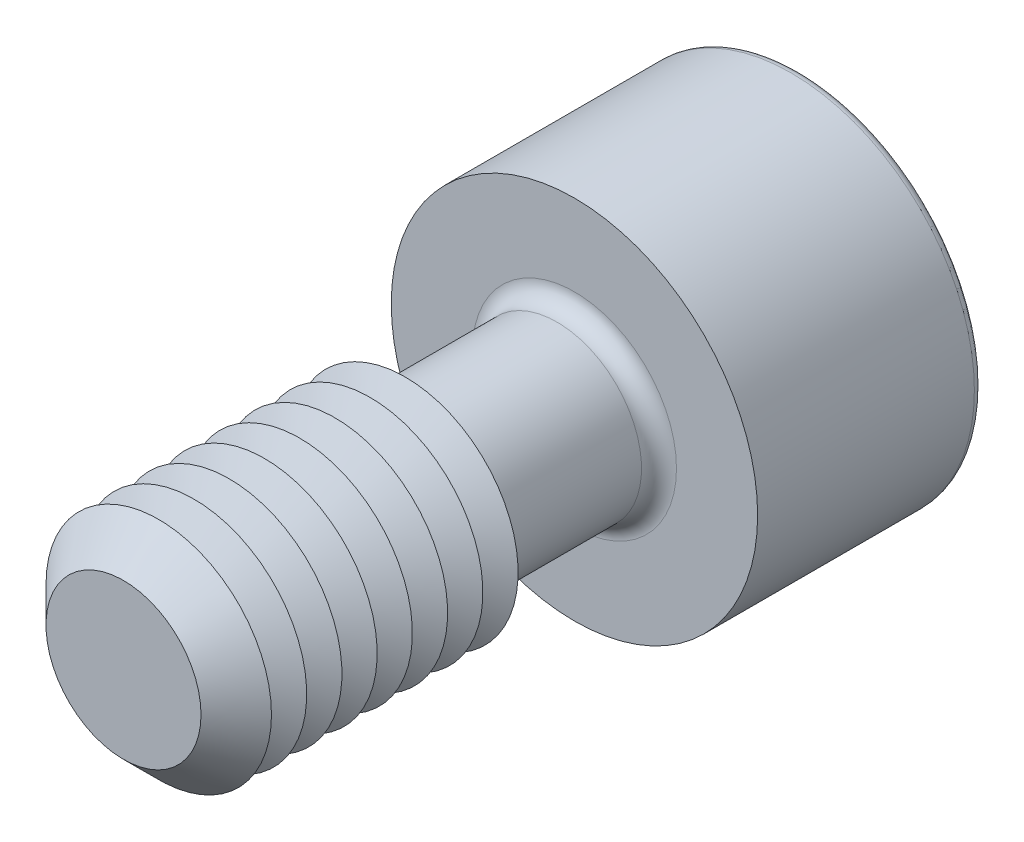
ISO-10303-21;
HEADER;
FILE_DESCRIPTION(('STEP AP214'),'2;1');
FILE_NAME('part.step','',(''),(''),'','','');
FILE_SCHEMA(('AUTOMOTIVE_DESIGN { 1 0 10303 214 1 1 1 1 }'));
ENDSEC;
DATA;
#1=APPLICATION_CONTEXT('core data for automotive mechanical design processes');
#2=APPLICATION_PROTOCOL_DEFINITION('international standard','automotive_design',2000,#1);
#3=PRODUCT_CONTEXT('',#1,'mechanical');
#4=PRODUCT('Part','Part','',(#3));
#5=PRODUCT_RELATED_PRODUCT_CATEGORY('part','',(#4));
#6=PRODUCT_DEFINITION_FORMATION('','',#4);
#7=PRODUCT_DEFINITION_CONTEXT('part definition',#1,'design');
#8=PRODUCT_DEFINITION('design','',#6,#7);
#9=PRODUCT_DEFINITION_SHAPE('','',#8);
#10=(LENGTH_UNIT() NAMED_UNIT(*) SI_UNIT(.MILLI.,.METRE.));
#11=(NAMED_UNIT(*) PLANE_ANGLE_UNIT() SI_UNIT($,.RADIAN.));
#12=(NAMED_UNIT(*) SI_UNIT($,.STERADIAN.) SOLID_ANGLE_UNIT());
#13=UNCERTAINTY_MEASURE_WITH_UNIT(LENGTH_MEASURE(1.E-05),#10,'distance_accuracy_value','');
#14=(GEOMETRIC_REPRESENTATION_CONTEXT(3) GLOBAL_UNCERTAINTY_ASSIGNED_CONTEXT((#13)) GLOBAL_UNIT_ASSIGNED_CONTEXT((#10,
#11,#12)) REPRESENTATION_CONTEXT('',''));
#15=CARTESIAN_POINT('',(0.,0.,0.));
#16=DIRECTION('',(0.,0.,1.));
#17=DIRECTION('',(1.,0.,0.));
#18=AXIS2_PLACEMENT_3D('',#15,#16,#17);
#19=CARTESIAN_POINT('',(-1.73205080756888,-3.,-10.));
#20=DIRECTION('',(0.,0.,1.));
#21=DIRECTION('',(1.,0.,0.));
#22=AXIS2_PLACEMENT_3D('',#19,#20,#21);
#23=PLANE('',#22);
#24=DIRECTION('',(1.,0.,0.));
#25=VECTOR('',#24,1.);
#26=CARTESIAN_POINT('',(-1.73205080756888,-3.,-10.));
#27=LINE('',#26,#25);
#28=CARTESIAN_POINT('',(0.,-3.,-10.));
#29=VERTEX_POINT('',#28);
#30=CARTESIAN_POINT('',(1.73205080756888,-3.,-10.));
#31=VERTEX_POINT('',#30);
#32=EDGE_CURVE('E405',#29,#31,#27,.T.);
#33=ORIENTED_EDGE('',*,*,#32,.F.);
#34=CARTESIAN_POINT('',(0.,0.,-10.));
#35=DIRECTION('',(0.,0.,1.));
#36=DIRECTION('',(0.,-1.,0.));
#37=AXIS2_PLACEMENT_3D('',#34,#35,#36);
#38=CIRCLE('',#37,3.);
#39=CARTESIAN_POINT('',(2.59807621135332,-1.5,-10.));
#40=VERTEX_POINT('',#39);
#41=EDGE_CURVE('E53',#29,#40,#38,.T.);
#42=ORIENTED_EDGE('',*,*,#41,.T.);
#43=DIRECTION('',(0.5,0.866025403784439,0.));
#44=VECTOR('',#43,1.);
#45=CARTESIAN_POINT('',(1.73205080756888,-3.,-10.));
#46=LINE('',#45,#44);
#47=EDGE_CURVE('E395',#31,#40,#46,.T.);
#48=ORIENTED_EDGE('',*,*,#47,.F.);
#49=EDGE_LOOP('',(#33,#42,#48));
#50=FACE_BOUND('',#49,.T.);
#51=ADVANCED_FACE('F41',(#50),#23,.F.);
#52=CARTESIAN_POINT('',(3.46410161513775,0.,-10.));
#53=VERTEX_POINT('',#52);
#54=EDGE_CURVE('E399',#40,#53,#46,.T.);
#55=ORIENTED_EDGE('',*,*,#54,.F.);
#56=CARTESIAN_POINT('',(2.59807621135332,1.5,-10.));
#57=VERTEX_POINT('',#56);
#58=EDGE_CURVE('E11',#40,#57,#38,.T.);
#59=ORIENTED_EDGE('',*,*,#58,.T.);
#60=DIRECTION('',(-0.5,0.866025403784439,0.));
#61=VECTOR('',#60,1.);
#62=CARTESIAN_POINT('',(3.46410161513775,0.,-10.));
#63=LINE('',#62,#61);
#64=EDGE_CURVE('E391',#53,#57,#63,.T.);
#65=ORIENTED_EDGE('',*,*,#64,.F.);
#66=EDGE_LOOP('',(#55,#59,#65));
#67=FACE_BOUND('',#66,.T.);
#68=ADVANCED_FACE('F133',(#67),#23,.F.);
#69=CARTESIAN_POINT('',(1.73205080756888,3.,-10.));
#70=VERTEX_POINT('',#69);
#71=EDGE_CURVE('E390',#57,#70,#63,.T.);
#72=ORIENTED_EDGE('',*,*,#71,.F.);
#73=CARTESIAN_POINT('',(0.,3.00000000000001,-9.99999999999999));
#74=VERTEX_POINT('',#73);
#75=EDGE_CURVE('E51',#57,#74,#38,.T.);
#76=ORIENTED_EDGE('',*,*,#75,.T.);
#77=DIRECTION('',(-1.,0.,0.));
#78=VECTOR('',#77,1.);
#79=CARTESIAN_POINT('',(1.73205080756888,3.,-10.));
#80=LINE('',#79,#78);
#81=EDGE_CURVE('E177',#70,#74,#80,.T.);
#82=ORIENTED_EDGE('',*,*,#81,.F.);
#83=EDGE_LOOP('',(#72,#76,#82));
#84=FACE_BOUND('',#83,.T.);
#85=ADVANCED_FACE('F139',(#84),#23,.F.);
#86=CARTESIAN_POINT('',(-1.73205080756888,3.,-10.));
#87=VERTEX_POINT('',#86);
#88=EDGE_CURVE('E397',#74,#87,#80,.T.);
#89=ORIENTED_EDGE('',*,*,#88,.F.);
#90=CARTESIAN_POINT('',(-2.59807621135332,1.5,-10.));
#91=VERTEX_POINT('',#90);
#92=EDGE_CURVE('E265',#74,#91,#38,.T.);
#93=ORIENTED_EDGE('',*,*,#92,.T.);
#94=DIRECTION('',(-0.5,-0.866025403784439,0.));
#95=VECTOR('',#94,1.);
#96=CARTESIAN_POINT('',(-1.73205080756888,3.,-10.));
#97=LINE('',#96,#95);
#98=EDGE_CURVE('E176',#87,#91,#97,.T.);
#99=ORIENTED_EDGE('',*,*,#98,.F.);
#100=EDGE_LOOP('',(#89,#93,#99));
#101=FACE_BOUND('',#100,.T.);
#102=ADVANCED_FACE('F157',(#101),#23,.F.);
#103=CARTESIAN_POINT('',(-3.46410161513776,0.,-10.));
#104=VERTEX_POINT('',#103);
#105=EDGE_CURVE('E170',#91,#104,#97,.T.);
#106=ORIENTED_EDGE('',*,*,#105,.F.);
#107=CARTESIAN_POINT('',(-2.59807621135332,-1.5,-10.));
#108=VERTEX_POINT('',#107);
#109=EDGE_CURVE('E172',#91,#108,#38,.T.);
#110=ORIENTED_EDGE('',*,*,#109,.T.);
#111=DIRECTION('',(0.5,-0.866025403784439,0.));
#112=VECTOR('',#111,1.);
#113=CARTESIAN_POINT('',(-3.46410161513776,0.,-10.));
#114=LINE('',#113,#112);
#115=EDGE_CURVE('E174',#104,#108,#114,.T.);
#116=ORIENTED_EDGE('',*,*,#115,.F.);
#117=EDGE_LOOP('',(#106,#110,#116));
#118=FACE_BOUND('',#117,.T.);
#119=ADVANCED_FACE('F146',(#118),#23,.F.);
#120=CARTESIAN_POINT('',(0.,0.,-16.));
#121=DIRECTION('',(0.,0.,-1.));
#122=DIRECTION('',(-1.,0.,0.));
#123=AXIS2_PLACEMENT_3D('',#120,#121,#122);
#124=PLANE('',#123);
#125=CARTESIAN_POINT('',(0.,0.,-16.));
#126=DIRECTION('',(0.,0.,-1.));
#127=DIRECTION('',(-1.,0.,0.));
#128=AXIS2_PLACEMENT_3D('',#125,#126,#127);
#129=CIRCLE('',#128,6.19);
#130=CARTESIAN_POINT('',(-6.19,0.,-16.));
#131=VERTEX_POINT('',#130);
#132=EDGE_CURVE('E250',#131,#131,#129,.T.);
#133=ORIENTED_EDGE('',*,*,#132,.T.);
#134=EDGE_LOOP('',(#133));
#135=FACE_BOUND('',#134,.T.);
#136=DIRECTION('',(-0.5,-0.866025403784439,0.));
#137=VECTOR('',#136,1.);
#138=CARTESIAN_POINT('',(-1.73205080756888,3.,-16.));
#139=LINE('',#138,#137);
#140=CARTESIAN_POINT('',(-1.73205080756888,3.,-16.));
#141=VERTEX_POINT('',#140);
#142=CARTESIAN_POINT('',(-3.46410161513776,0.,-16.));
#143=VERTEX_POINT('',#142);
#144=EDGE_CURVE('E212',#141,#143,#139,.T.);
#145=ORIENTED_EDGE('',*,*,#144,.T.);
#146=DIRECTION('',(0.5,-0.866025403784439,0.));
#147=VECTOR('',#146,1.);
#148=CARTESIAN_POINT('',(-3.46410161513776,0.,-16.));
#149=LINE('',#148,#147);
#150=CARTESIAN_POINT('',(-1.73205080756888,-3.,-16.));
#151=VERTEX_POINT('',#150);
#152=EDGE_CURVE('E67',#143,#151,#149,.T.);
#153=ORIENTED_EDGE('',*,*,#152,.T.);
#154=DIRECTION('',(1.,0.,0.));
#155=VECTOR('',#154,1.);
#156=CARTESIAN_POINT('',(-1.73205080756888,-3.,-16.));
#157=LINE('',#156,#155);
#158=CARTESIAN_POINT('',(1.73205080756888,-3.,-16.));
#159=VERTEX_POINT('',#158);
#160=EDGE_CURVE('E196',#151,#159,#157,.T.);
#161=ORIENTED_EDGE('',*,*,#160,.T.);
#162=DIRECTION('',(0.5,0.866025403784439,0.));
#163=VECTOR('',#162,1.);
#164=CARTESIAN_POINT('',(1.73205080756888,-3.,-16.));
#165=LINE('',#164,#163);
#166=CARTESIAN_POINT('',(3.46410161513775,0.,-16.));
#167=VERTEX_POINT('',#166);
#168=EDGE_CURVE('E200',#159,#167,#165,.T.);
#169=ORIENTED_EDGE('',*,*,#168,.T.);
#170=DIRECTION('',(-0.5,0.866025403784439,0.));
#171=VECTOR('',#170,1.);
#172=CARTESIAN_POINT('',(3.46410161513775,0.,-16.));
#173=LINE('',#172,#171);
#174=CARTESIAN_POINT('',(1.73205080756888,3.,-16.));
#175=VERTEX_POINT('',#174);
#176=EDGE_CURVE('E204',#167,#175,#173,.T.);
#177=ORIENTED_EDGE('',*,*,#176,.T.);
#178=DIRECTION('',(-1.,0.,0.));
#179=VECTOR('',#178,1.);
#180=CARTESIAN_POINT('',(1.73205080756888,3.,-16.));
#181=LINE('',#180,#179);
#182=EDGE_CURVE('E208',#175,#141,#181,.T.);
#183=ORIENTED_EDGE('',*,*,#182,.T.);
#184=EDGE_LOOP('',(#145,#153,#161,#169,#177,#183));
#185=FACE_BOUND('',#184,.T.);
#186=ADVANCED_FACE('F156',(#135,#185),#124,.T.);
#187=CARTESIAN_POINT('',(0.,0.,8.));
#188=DIRECTION('',(0.,0.,-1.));
#189=DIRECTION('',(-1.,0.,0.));
#190=AXIS2_PLACEMENT_3D('',#187,#188,#189);
#191=CYLINDRICAL_SURFACE('',#190,3.);
#192=CARTESIAN_POINT('',(0.,0.,-7.38));
#193=DIRECTION('',(0.,0.,-1.));
#194=DIRECTION('',(-1.,0.,0.));
#195=AXIS2_PLACEMENT_3D('',#192,#193,#194);
#196=CIRCLE('',#195,3.);
#197=CARTESIAN_POINT('',(-3.,0.,-7.38));
#198=VERTEX_POINT('',#197);
#199=EDGE_CURVE('E247',#198,#198,#196,.F.);
#200=ORIENTED_EDGE('',*,*,#199,.T.);
#201=EDGE_LOOP('',(#200));
#202=FACE_BOUND('',#201,.T.);
#203=CARTESIAN_POINT('',(0.,0.,-2.57735026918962));
#204=DIRECTION('',(0.,0.,-1.));
#205=DIRECTION('',(0.,1.,0.));
#206=AXIS2_PLACEMENT_3D('',#203,#204,#205);
#207=CIRCLE('',#206,3.);
#208=CARTESIAN_POINT('',(0.,3.,-2.57735026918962));
#209=VERTEX_POINT('',#208);
#210=EDGE_CURVE('E235',#209,#209,#207,.T.);
#211=ORIENTED_EDGE('',*,*,#210,.T.);
#212=EDGE_LOOP('',(#211));
#213=FACE_BOUND('',#212,.T.);
#214=ADVANCED_FACE('F163',(#202,#213),#191,.T.);
#215=CARTESIAN_POINT('',(0.,0.,-2.57735026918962));
#216=DIRECTION('',(0.,0.,1.));
#217=DIRECTION('',(0.,-1.,0.));
#218=AXIS2_PLACEMENT_3D('',#215,#216,#217);
#219=CONICAL_SURFACE('',#218,3.,1.0471975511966);
#220=CARTESIAN_POINT('',(0.,0.,-2.));
#221=DIRECTION('',(0.,0.,-1.));
#222=DIRECTION('',(-1.,0.,0.));
#223=AXIS2_PLACEMENT_3D('',#220,#221,#222);
#224=CIRCLE('',#223,4.);
#225=CARTESIAN_POINT('',(-4.,0.,-2.));
#226=VERTEX_POINT('',#225);
#227=EDGE_CURVE('E268',#226,#226,#224,.T.);
#228=ORIENTED_EDGE('',*,*,#227,.T.);
#229=EDGE_LOOP('',(#228));
#230=FACE_BOUND('',#229,.T.);
#231=ORIENTED_EDGE('',*,*,#210,.F.);
#232=EDGE_LOOP('',(#231));
#233=FACE_BOUND('',#232,.T.);
#234=ADVANCED_FACE('F348',(#230,#233),#219,.T.);
#235=CARTESIAN_POINT('',(0.,0.,-8.));
#236=DIRECTION('',(0.,0.,-1.));
#237=DIRECTION('',(-1.,0.,0.));
#238=AXIS2_PLACEMENT_3D('',#235,#236,#237);
#239=PLANE('',#238);
#240=CARTESIAN_POINT('',(0.,0.,-8.));
#241=DIRECTION('',(0.,0.,-1.));
#242=DIRECTION('',(-1.,0.,0.));
#243=AXIS2_PLACEMENT_3D('',#240,#241,#242);
#244=CIRCLE('',#243,3.62);
#245=CARTESIAN_POINT('',(-3.62,0.,-8.));
#246=VERTEX_POINT('',#245);
#247=EDGE_CURVE('E243',#246,#246,#244,.T.);
#248=ORIENTED_EDGE('',*,*,#247,.T.);
#249=EDGE_LOOP('',(#248));
#250=FACE_BOUND('',#249,.T.);
#251=CARTESIAN_POINT('',(0.,0.,-8.));
#252=DIRECTION('',(0.,0.,-1.));
#253=DIRECTION('',(-1.,0.,0.));
#254=AXIS2_PLACEMENT_3D('',#251,#252,#253);
#255=CIRCLE('',#254,6.5);
#256=CARTESIAN_POINT('',(-6.5,0.,-8.));
#257=VERTEX_POINT('',#256);
#258=EDGE_CURVE('E231',#257,#257,#255,.T.);
#259=ORIENTED_EDGE('',*,*,#258,.F.);
#260=EDGE_LOOP('',(#259));
#261=FACE_BOUND('',#260,.T.);
#262=ADVANCED_FACE('F353',(#250,#261),#239,.F.);
#263=CARTESIAN_POINT('',(0.,0.,-16.));
#264=DIRECTION('',(0.,0.,1.));
#265=DIRECTION('',(1.,0.,0.));
#266=AXIS2_PLACEMENT_3D('',#263,#264,#265);
#267=CYLINDRICAL_SURFACE('',#266,6.5);
#268=CARTESIAN_POINT('',(0.,0.,-15.69));
#269=DIRECTION('',(0.,0.,-1.));
#270=DIRECTION('',(-1.,0.,0.));
#271=AXIS2_PLACEMENT_3D('',#268,#269,#270);
#272=CIRCLE('',#271,6.5);
#273=CARTESIAN_POINT('',(-6.5,0.,-15.69));
#274=VERTEX_POINT('',#273);
#275=EDGE_CURVE('E45',#274,#274,#272,.F.);
#276=ORIENTED_EDGE('',*,*,#275,.T.);
#277=EDGE_LOOP('',(#276));
#278=FACE_BOUND('',#277,.T.);
#279=ORIENTED_EDGE('',*,*,#258,.T.);
#280=EDGE_LOOP('',(#279));
#281=FACE_BOUND('',#280,.T.);
#282=ADVANCED_FACE('F354',(#278,#281),#267,.T.);
#283=CARTESIAN_POINT('',(-3.46410161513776,0.,-10.));
#284=DIRECTION('',(0.866025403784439,0.5,0.));
#285=DIRECTION('',(-0.5,0.866025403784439,0.));
#286=AXIS2_PLACEMENT_3D('',#283,#284,#285);
#287=PLANE('',#286);
#288=ORIENTED_EDGE('',*,*,#152,.F.);
#289=DIRECTION('',(0.,0.,-1.));
#290=VECTOR('',#289,1.);
#291=CARTESIAN_POINT('',(-3.46410161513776,0.,-10.));
#292=LINE('',#291,#290);
#293=EDGE_CURVE('E186',#104,#143,#292,.T.);
#294=ORIENTED_EDGE('',*,*,#293,.F.);
#295=ORIENTED_EDGE('',*,*,#115,.T.);
#296=CARTESIAN_POINT('',(-1.73205080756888,-3.,-10.));
#297=VERTEX_POINT('',#296);
#298=EDGE_CURVE('E215',#108,#297,#114,.T.);
#299=ORIENTED_EDGE('',*,*,#298,.T.);
#300=DIRECTION('',(0.,0.,-1.));
#301=VECTOR('',#300,1.);
#302=CARTESIAN_POINT('',(-1.73205080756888,-3.,-10.));
#303=LINE('',#302,#301);
#304=EDGE_CURVE('E228',#297,#151,#303,.T.);
#305=ORIENTED_EDGE('',*,*,#304,.T.);
#306=EDGE_LOOP('',(#288,#294,#295,#299,#305));
#307=FACE_BOUND('',#306,.T.);
#308=ADVANCED_FACE('F357',(#307),#287,.T.);
#309=CARTESIAN_POINT('',(-1.73205080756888,-3.,-10.));
#310=DIRECTION('',(0.,1.,0.));
#311=DIRECTION('',(-1.,0.,0.));
#312=AXIS2_PLACEMENT_3D('',#309,#310,#311);
#313=PLANE('',#312);
#314=ORIENTED_EDGE('',*,*,#160,.F.);
#315=ORIENTED_EDGE('',*,*,#304,.F.);
#316=EDGE_CURVE('E402',#297,#29,#27,.T.);
#317=ORIENTED_EDGE('',*,*,#316,.T.);
#318=ORIENTED_EDGE('',*,*,#32,.T.);
#319=DIRECTION('',(0.,0.,-1.));
#320=VECTOR('',#319,1.);
#321=CARTESIAN_POINT('',(1.73205080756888,-3.,-10.));
#322=LINE('',#321,#320);
#323=EDGE_CURVE('E225',#31,#159,#322,.T.);
#324=ORIENTED_EDGE('',*,*,#323,.T.);
#325=EDGE_LOOP('',(#314,#315,#317,#318,#324));
#326=FACE_BOUND('',#325,.T.);
#327=ADVANCED_FACE('F363',(#326),#313,.T.);
#328=CARTESIAN_POINT('',(1.73205080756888,-3.,-10.));
#329=DIRECTION('',(-0.866025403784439,0.5,0.));
#330=DIRECTION('',(-0.5,-0.866025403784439,0.));
#331=AXIS2_PLACEMENT_3D('',#328,#329,#330);
#332=PLANE('',#331);
#333=ORIENTED_EDGE('',*,*,#168,.F.);
#334=ORIENTED_EDGE('',*,*,#323,.F.);
#335=ORIENTED_EDGE('',*,*,#47,.T.);
#336=ORIENTED_EDGE('',*,*,#54,.T.);
#337=DIRECTION('',(0.,0.,-1.));
#338=VECTOR('',#337,1.);
#339=CARTESIAN_POINT('',(3.46410161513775,0.,-10.));
#340=LINE('',#339,#338);
#341=EDGE_CURVE('E222',#53,#167,#340,.T.);
#342=ORIENTED_EDGE('',*,*,#341,.T.);
#343=EDGE_LOOP('',(#333,#334,#335,#336,#342));
#344=FACE_BOUND('',#343,.T.);
#345=ADVANCED_FACE('F366',(#344),#332,.T.);
#346=CARTESIAN_POINT('',(3.46410161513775,0.,-10.));
#347=DIRECTION('',(-0.866025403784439,-0.499999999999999,0.));
#348=DIRECTION('',(0.5,-0.866025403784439,0.));
#349=AXIS2_PLACEMENT_3D('',#346,#347,#348);
#350=PLANE('',#349);
#351=ORIENTED_EDGE('',*,*,#176,.F.);
#352=ORIENTED_EDGE('',*,*,#341,.F.);
#353=ORIENTED_EDGE('',*,*,#64,.T.);
#354=ORIENTED_EDGE('',*,*,#71,.T.);
#355=DIRECTION('',(0.,0.,-1.));
#356=VECTOR('',#355,1.);
#357=CARTESIAN_POINT('',(1.73205080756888,3.,-10.));
#358=LINE('',#357,#356);
#359=EDGE_CURVE('E219',#70,#175,#358,.T.);
#360=ORIENTED_EDGE('',*,*,#359,.T.);
#361=EDGE_LOOP('',(#351,#352,#353,#354,#360));
#362=FACE_BOUND('',#361,.T.);
#363=ADVANCED_FACE('F370',(#362),#350,.T.);
#364=CARTESIAN_POINT('',(1.73205080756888,3.,-10.));
#365=DIRECTION('',(0.,-1.,0.));
#366=DIRECTION('',(1.,0.,0.));
#367=AXIS2_PLACEMENT_3D('',#364,#365,#366);
#368=PLANE('',#367);
#369=ORIENTED_EDGE('',*,*,#182,.F.);
#370=ORIENTED_EDGE('',*,*,#359,.F.);
#371=ORIENTED_EDGE('',*,*,#81,.T.);
#372=ORIENTED_EDGE('',*,*,#88,.T.);
#373=DIRECTION('',(0.,0.,-1.));
#374=VECTOR('',#373,1.);
#375=CARTESIAN_POINT('',(-1.73205080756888,3.,-10.));
#376=LINE('',#375,#374);
#377=EDGE_CURVE('E182',#87,#141,#376,.T.);
#378=ORIENTED_EDGE('',*,*,#377,.T.);
#379=EDGE_LOOP('',(#369,#370,#371,#372,#378));
#380=FACE_BOUND('',#379,.T.);
#381=ADVANCED_FACE('F152',(#380),#368,.T.);
#382=CARTESIAN_POINT('',(-1.73205080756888,3.,-10.));
#383=DIRECTION('',(0.866025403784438,-0.5,0.));
#384=DIRECTION('',(0.5,0.866025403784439,0.));
#385=AXIS2_PLACEMENT_3D('',#382,#383,#384);
#386=PLANE('',#385);
#387=ORIENTED_EDGE('',*,*,#144,.F.);
#388=ORIENTED_EDGE('',*,*,#377,.F.);
#389=ORIENTED_EDGE('',*,*,#98,.T.);
#390=ORIENTED_EDGE('',*,*,#105,.T.);
#391=ORIENTED_EDGE('',*,*,#293,.T.);
#392=EDGE_LOOP('',(#387,#388,#389,#390,#391));
#393=FACE_BOUND('',#392,.T.);
#394=ADVANCED_FACE('F144',(#393),#386,.T.);
#395=ORIENTED_EDGE('',*,*,#298,.F.);
#396=EDGE_CURVE('E258',#108,#29,#38,.T.);
#397=ORIENTED_EDGE('',*,*,#396,.T.);
#398=ORIENTED_EDGE('',*,*,#316,.F.);
#399=EDGE_LOOP('',(#395,#397,#398));
#400=FACE_BOUND('',#399,.T.);
#401=ADVANCED_FACE('F135',(#400),#23,.F.);
#402=CARTESIAN_POINT('',(0.,0.,-7.38));
#403=DIRECTION('',(0.,0.,-1.));
#404=DIRECTION('',(-1.,0.,0.));
#405=AXIS2_PLACEMENT_3D('',#402,#403,#404);
#406=TOROIDAL_SURFACE('',#405,3.62,0.62);
#407=ORIENTED_EDGE('',*,*,#199,.F.);
#408=EDGE_LOOP('',(#407));
#409=FACE_BOUND('',#408,.T.);
#410=ORIENTED_EDGE('',*,*,#247,.F.);
#411=EDGE_LOOP('',(#410));
#412=FACE_BOUND('',#411,.T.);
#413=ADVANCED_FACE('F129',(#409,#412),#406,.F.);
#414=CARTESIAN_POINT('',(0.,0.,-15.69));
#415=DIRECTION('',(0.,0.,-1.));
#416=DIRECTION('',(-1.,0.,0.));
#417=AXIS2_PLACEMENT_3D('',#414,#415,#416);
#418=TOROIDAL_SURFACE('',#417,6.19,0.31);
#419=ORIENTED_EDGE('',*,*,#275,.F.);
#420=EDGE_LOOP('',(#419));
#421=FACE_BOUND('',#420,.T.);
#422=ORIENTED_EDGE('',*,*,#132,.F.);
#423=EDGE_LOOP('',(#422));
#424=FACE_BOUND('',#423,.T.);
#425=ADVANCED_FACE('F43',(#421,#424),#418,.T.);
#426=CARTESIAN_POINT('',(0.,0.,-8.26794919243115));
#427=DIRECTION('',(0.,0.,-1.));
#428=DIRECTION('',(0.,1.,0.));
#429=AXIS2_PLACEMENT_3D('',#426,#427,#428);
#430=CONICAL_SURFACE('',#429,0.,1.04719755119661);
#431=ORIENTED_EDGE('',*,*,#41,.F.);
#432=ORIENTED_EDGE('',*,*,#396,.F.);
#433=ORIENTED_EDGE('',*,*,#109,.F.);
#434=ORIENTED_EDGE('',*,*,#92,.F.);
#435=ORIENTED_EDGE('',*,*,#75,.F.);
#436=ORIENTED_EDGE('',*,*,#58,.F.);
#437=EDGE_LOOP('',(#431,#432,#433,#434,#435,#436));
#438=FACE_BOUND('',#437,.T.);
#439=CARTESIAN_POINT('',(0.,0.,-8.26794919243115));
#440=VERTEX_POINT('',#439);
#441=VERTEX_LOOP('',#440);
#442=FACE_BOUND('',#441,.T.);
#443=ADVANCED_FACE('F118',(#438,#442),#430,.F.);
#444=CARTESIAN_POINT('',(0.,0.,-1.375));
#445=DIRECTION('',(0.,0.,-1.));
#446=DIRECTION('',(-1.,0.,0.));
#447=AXIS2_PLACEMENT_3D('',#444,#445,#446);
#448=CONICAL_SURFACE('',#447,2.91746824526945,1.0471975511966);
#449=ORIENTED_EDGE('',*,*,#227,.F.);
#450=EDGE_LOOP('',(#449));
#451=FACE_BOUND('',#450,.T.);
#452=CARTESIAN_POINT('',(0.,0.,-1.375));
#453=DIRECTION('',(0.,0.,-1.));
#454=DIRECTION('',(-1.,0.,0.));
#455=AXIS2_PLACEMENT_3D('',#452,#453,#454);
#456=CIRCLE('',#455,2.91746824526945);
#457=CARTESIAN_POINT('',(-2.91746824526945,0.,-1.375));
#458=VERTEX_POINT('',#457);
#459=EDGE_CURVE('E274',#458,#458,#456,.T.);
#460=ORIENTED_EDGE('',*,*,#459,.T.);
#461=EDGE_LOOP('',(#460));
#462=FACE_BOUND('',#461,.T.);
#463=ADVANCED_FACE('F120',(#451,#462),#448,.T.);
#464=CARTESIAN_POINT('',(0.,0.,-0.750000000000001));
#465=DIRECTION('',(0.,0.,1.));
#466=DIRECTION('',(1.,0.,0.));
#467=AXIS2_PLACEMENT_3D('',#464,#465,#466);
#468=CONICAL_SURFACE('',#467,4.,1.0471975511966);
#469=ORIENTED_EDGE('',*,*,#459,.F.);
#470=EDGE_LOOP('',(#469));
#471=FACE_BOUND('',#470,.T.);
#472=CARTESIAN_POINT('',(0.,0.,-0.750000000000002));
#473=DIRECTION('',(0.,0.,-1.));
#474=DIRECTION('',(-1.,0.,0.));
#475=AXIS2_PLACEMENT_3D('',#472,#473,#474);
#476=CIRCLE('',#475,4.);
#477=CARTESIAN_POINT('',(-4.,0.,-0.750000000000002));
#478=VERTEX_POINT('',#477);
#479=EDGE_CURVE('E279',#478,#478,#476,.T.);
#480=ORIENTED_EDGE('',*,*,#479,.T.);
#481=EDGE_LOOP('',(#480));
#482=FACE_BOUND('',#481,.T.);
#483=ADVANCED_FACE('F126',(#471,#482),#468,.T.);
#484=CARTESIAN_POINT('',(0.,0.,-0.125000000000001));
#485=DIRECTION('',(0.,0.,-1.));
#486=DIRECTION('',(-1.,0.,0.));
#487=AXIS2_PLACEMENT_3D('',#484,#485,#486);
#488=CONICAL_SURFACE('',#487,2.91746824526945,1.0471975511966);
#489=ORIENTED_EDGE('',*,*,#479,.F.);
#490=EDGE_LOOP('',(#489));
#491=FACE_BOUND('',#490,.T.);
#492=CARTESIAN_POINT('',(0.,0.,-0.125000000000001));
#493=DIRECTION('',(0.,0.,-1.));
#494=DIRECTION('',(-1.,0.,0.));
#495=AXIS2_PLACEMENT_3D('',#492,#493,#494);
#496=CIRCLE('',#495,2.91746824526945);
#497=CARTESIAN_POINT('',(-2.91746824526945,0.,-0.125000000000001));
#498=VERTEX_POINT('',#497);
#499=EDGE_CURVE('E285',#498,#498,#496,.T.);
#500=ORIENTED_EDGE('',*,*,#499,.T.);
#501=EDGE_LOOP('',(#500));
#502=FACE_BOUND('',#501,.T.);
#503=ADVANCED_FACE('F508',(#491,#502),#488,.T.);
#504=CARTESIAN_POINT('',(0.,0.,0.499999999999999));
#505=DIRECTION('',(0.,0.,1.));
#506=DIRECTION('',(1.,0.,0.));
#507=AXIS2_PLACEMENT_3D('',#504,#505,#506);
#508=CONICAL_SURFACE('',#507,4.,1.0471975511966);
#509=ORIENTED_EDGE('',*,*,#499,.F.);
#510=EDGE_LOOP('',(#509));
#511=FACE_BOUND('',#510,.T.);
#512=CARTESIAN_POINT('',(0.,0.,0.499999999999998));
#513=DIRECTION('',(0.,0.,-1.));
#514=DIRECTION('',(-1.,0.,0.));
#515=AXIS2_PLACEMENT_3D('',#512,#513,#514);
#516=CIRCLE('',#515,4.);
#517=CARTESIAN_POINT('',(-4.,0.,0.499999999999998));
#518=VERTEX_POINT('',#517);
#519=EDGE_CURVE('E288',#518,#518,#516,.T.);
#520=ORIENTED_EDGE('',*,*,#519,.T.);
#521=EDGE_LOOP('',(#520));
#522=FACE_BOUND('',#521,.T.);
#523=ADVANCED_FACE('F517',(#511,#522),#508,.T.);
#524=CARTESIAN_POINT('',(0.,0.,1.125));
#525=DIRECTION('',(0.,0.,-1.));
#526=DIRECTION('',(-1.,0.,0.));
#527=AXIS2_PLACEMENT_3D('',#524,#525,#526);
#528=CONICAL_SURFACE('',#527,2.91746824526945,1.0471975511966);
#529=ORIENTED_EDGE('',*,*,#519,.F.);
#530=EDGE_LOOP('',(#529));
#531=FACE_BOUND('',#530,.T.);
#532=CARTESIAN_POINT('',(0.,0.,1.125));
#533=DIRECTION('',(0.,0.,-1.));
#534=DIRECTION('',(-1.,0.,0.));
#535=AXIS2_PLACEMENT_3D('',#532,#533,#534);
#536=CIRCLE('',#535,2.91746824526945);
#537=CARTESIAN_POINT('',(-2.91746824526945,0.,1.125));
#538=VERTEX_POINT('',#537);
#539=EDGE_CURVE('E292',#538,#538,#536,.T.);
#540=ORIENTED_EDGE('',*,*,#539,.T.);
#541=EDGE_LOOP('',(#540));
#542=FACE_BOUND('',#541,.T.);
#543=ADVANCED_FACE('F526',(#531,#542),#528,.T.);
#544=CARTESIAN_POINT('',(0.,0.,1.75));
#545=DIRECTION('',(0.,0.,1.));
#546=DIRECTION('',(1.,0.,0.));
#547=AXIS2_PLACEMENT_3D('',#544,#545,#546);
#548=CONICAL_SURFACE('',#547,4.,1.0471975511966);
#549=ORIENTED_EDGE('',*,*,#539,.F.);
#550=EDGE_LOOP('',(#549));
#551=FACE_BOUND('',#550,.T.);
#552=CARTESIAN_POINT('',(0.,0.,1.75));
#553=DIRECTION('',(0.,0.,-1.));
#554=DIRECTION('',(-1.,0.,0.));
#555=AXIS2_PLACEMENT_3D('',#552,#553,#554);
#556=CIRCLE('',#555,4.);
#557=CARTESIAN_POINT('',(-4.,0.,1.75));
#558=VERTEX_POINT('',#557);
#559=EDGE_CURVE('E295',#558,#558,#556,.T.);
#560=ORIENTED_EDGE('',*,*,#559,.T.);
#561=EDGE_LOOP('',(#560));
#562=FACE_BOUND('',#561,.T.);
#563=ADVANCED_FACE('F535',(#551,#562),#548,.T.);
#564=CARTESIAN_POINT('',(0.,0.,2.375));
#565=DIRECTION('',(0.,0.,-1.));
#566=DIRECTION('',(-1.,0.,0.));
#567=AXIS2_PLACEMENT_3D('',#564,#565,#566);
#568=CONICAL_SURFACE('',#567,2.91746824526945,1.0471975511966);
#569=ORIENTED_EDGE('',*,*,#559,.F.);
#570=EDGE_LOOP('',(#569));
#571=FACE_BOUND('',#570,.T.);
#572=CARTESIAN_POINT('',(0.,0.,2.375));
#573=DIRECTION('',(0.,0.,-1.));
#574=DIRECTION('',(-1.,0.,0.));
#575=AXIS2_PLACEMENT_3D('',#572,#573,#574);
#576=CIRCLE('',#575,2.91746824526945);
#577=CARTESIAN_POINT('',(-2.91746824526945,0.,2.375));
#578=VERTEX_POINT('',#577);
#579=EDGE_CURVE('E299',#578,#578,#576,.T.);
#580=ORIENTED_EDGE('',*,*,#579,.T.);
#581=EDGE_LOOP('',(#580));
#582=FACE_BOUND('',#581,.T.);
#583=ADVANCED_FACE('F544',(#571,#582),#568,.T.);
#584=CARTESIAN_POINT('',(0.,0.,3.));
#585=DIRECTION('',(0.,0.,1.));
#586=DIRECTION('',(1.,0.,0.));
#587=AXIS2_PLACEMENT_3D('',#584,#585,#586);
#588=CONICAL_SURFACE('',#587,4.,1.0471975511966);
#589=ORIENTED_EDGE('',*,*,#579,.F.);
#590=EDGE_LOOP('',(#589));
#591=FACE_BOUND('',#590,.T.);
#592=CARTESIAN_POINT('',(0.,0.,3.));
#593=DIRECTION('',(0.,0.,-1.));
#594=DIRECTION('',(-1.,0.,0.));
#595=AXIS2_PLACEMENT_3D('',#592,#593,#594);
#596=CIRCLE('',#595,4.);
#597=CARTESIAN_POINT('',(-4.,0.,3.));
#598=VERTEX_POINT('',#597);
#599=EDGE_CURVE('E303',#598,#598,#596,.T.);
#600=ORIENTED_EDGE('',*,*,#599,.T.);
#601=EDGE_LOOP('',(#600));
#602=FACE_BOUND('',#601,.T.);
#603=ADVANCED_FACE('F553',(#591,#602),#588,.T.);
#604=CARTESIAN_POINT('',(0.,0.,3.625));
#605=DIRECTION('',(0.,0.,-1.));
#606=DIRECTION('',(-1.,0.,0.));
#607=AXIS2_PLACEMENT_3D('',#604,#605,#606);
#608=CONICAL_SURFACE('',#607,2.91746824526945,1.0471975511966);
#609=ORIENTED_EDGE('',*,*,#599,.F.);
#610=EDGE_LOOP('',(#609));
#611=FACE_BOUND('',#610,.T.);
#612=CARTESIAN_POINT('',(0.,0.,3.625));
#613=DIRECTION('',(0.,0.,-1.));
#614=DIRECTION('',(-1.,0.,0.));
#615=AXIS2_PLACEMENT_3D('',#612,#613,#614);
#616=CIRCLE('',#615,2.91746824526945);
#617=CARTESIAN_POINT('',(-2.91746824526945,0.,3.625));
#618=VERTEX_POINT('',#617);
#619=EDGE_CURVE('E307',#618,#618,#616,.T.);
#620=ORIENTED_EDGE('',*,*,#619,.T.);
#621=EDGE_LOOP('',(#620));
#622=FACE_BOUND('',#621,.T.);
#623=ADVANCED_FACE('F562',(#611,#622),#608,.T.);
#624=CARTESIAN_POINT('',(0.,0.,4.25));
#625=DIRECTION('',(0.,0.,1.));
#626=DIRECTION('',(1.,0.,0.));
#627=AXIS2_PLACEMENT_3D('',#624,#625,#626);
#628=CONICAL_SURFACE('',#627,4.,1.0471975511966);
#629=ORIENTED_EDGE('',*,*,#619,.F.);
#630=EDGE_LOOP('',(#629));
#631=FACE_BOUND('',#630,.T.);
#632=CARTESIAN_POINT('',(0.,0.,4.25));
#633=DIRECTION('',(0.,0.,-1.));
#634=DIRECTION('',(-1.,0.,0.));
#635=AXIS2_PLACEMENT_3D('',#632,#633,#634);
#636=CIRCLE('',#635,4.);
#637=CARTESIAN_POINT('',(-4.,0.,4.25));
#638=VERTEX_POINT('',#637);
#639=EDGE_CURVE('E310',#638,#638,#636,.T.);
#640=ORIENTED_EDGE('',*,*,#639,.T.);
#641=EDGE_LOOP('',(#640));
#642=FACE_BOUND('',#641,.T.);
#643=ADVANCED_FACE('F571',(#631,#642),#628,.T.);
#644=CARTESIAN_POINT('',(0.,0.,4.875));
#645=DIRECTION('',(0.,0.,-1.));
#646=DIRECTION('',(-1.,0.,0.));
#647=AXIS2_PLACEMENT_3D('',#644,#645,#646);
#648=CONICAL_SURFACE('',#647,2.91746824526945,1.0471975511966);
#649=ORIENTED_EDGE('',*,*,#639,.F.);
#650=EDGE_LOOP('',(#649));
#651=FACE_BOUND('',#650,.T.);
#652=CARTESIAN_POINT('',(0.,0.,4.875));
#653=DIRECTION('',(0.,0.,-1.));
#654=DIRECTION('',(-1.,0.,0.));
#655=AXIS2_PLACEMENT_3D('',#652,#653,#654);
#656=CIRCLE('',#655,2.91746824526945);
#657=CARTESIAN_POINT('',(-2.91746824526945,0.,4.875));
#658=VERTEX_POINT('',#657);
#659=EDGE_CURVE('E314',#658,#658,#656,.T.);
#660=ORIENTED_EDGE('',*,*,#659,.T.);
#661=EDGE_LOOP('',(#660));
#662=FACE_BOUND('',#661,.T.);
#663=ADVANCED_FACE('F580',(#651,#662),#648,.T.);
#664=CARTESIAN_POINT('',(0.,0.,5.5));
#665=DIRECTION('',(0.,0.,1.));
#666=DIRECTION('',(1.,0.,0.));
#667=AXIS2_PLACEMENT_3D('',#664,#665,#666);
#668=CONICAL_SURFACE('',#667,4.,1.0471975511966);
#669=ORIENTED_EDGE('',*,*,#659,.F.);
#670=EDGE_LOOP('',(#669));
#671=FACE_BOUND('',#670,.T.);
#672=CARTESIAN_POINT('',(0.,0.,5.5));
#673=DIRECTION('',(0.,0.,-1.));
#674=DIRECTION('',(-1.,0.,0.));
#675=AXIS2_PLACEMENT_3D('',#672,#673,#674);
#676=CIRCLE('',#675,4.);
#677=CARTESIAN_POINT('',(-4.,0.,5.5));
#678=VERTEX_POINT('',#677);
#679=EDGE_CURVE('E318',#678,#678,#676,.T.);
#680=ORIENTED_EDGE('',*,*,#679,.T.);
#681=EDGE_LOOP('',(#680));
#682=FACE_BOUND('',#681,.T.);
#683=ADVANCED_FACE('F589',(#671,#682),#668,.T.);
#684=CARTESIAN_POINT('',(0.,0.,6.125));
#685=DIRECTION('',(0.,0.,-1.));
#686=DIRECTION('',(-1.,0.,0.));
#687=AXIS2_PLACEMENT_3D('',#684,#685,#686);
#688=CONICAL_SURFACE('',#687,2.91746824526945,1.0471975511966);
#689=ORIENTED_EDGE('',*,*,#679,.F.);
#690=EDGE_LOOP('',(#689));
#691=FACE_BOUND('',#690,.T.);
#692=CARTESIAN_POINT('',(0.,0.,6.125));
#693=DIRECTION('',(0.,0.,-1.));
#694=DIRECTION('',(-1.,0.,0.));
#695=AXIS2_PLACEMENT_3D('',#692,#693,#694);
#696=CIRCLE('',#695,2.91746824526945);
#697=CARTESIAN_POINT('',(-2.91746824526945,0.,6.125));
#698=VERTEX_POINT('',#697);
#699=EDGE_CURVE('E322',#698,#698,#696,.T.);
#700=ORIENTED_EDGE('',*,*,#699,.T.);
#701=EDGE_LOOP('',(#700));
#702=FACE_BOUND('',#701,.T.);
#703=ADVANCED_FACE('F598',(#691,#702),#688,.T.);
#704=CARTESIAN_POINT('',(0.,0.,6.75));
#705=DIRECTION('',(0.,0.,1.));
#706=DIRECTION('',(1.,0.,0.));
#707=AXIS2_PLACEMENT_3D('',#704,#705,#706);
#708=CONICAL_SURFACE('',#707,4.,1.0471975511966);
#709=ORIENTED_EDGE('',*,*,#699,.F.);
#710=EDGE_LOOP('',(#709));
#711=FACE_BOUND('',#710,.T.);
#712=CARTESIAN_POINT('',(0.,0.,6.75));
#713=DIRECTION('',(0.,0.,-1.));
#714=DIRECTION('',(-1.,0.,0.));
#715=AXIS2_PLACEMENT_3D('',#712,#713,#714);
#716=CIRCLE('',#715,4.);
#717=CARTESIAN_POINT('',(-4.,0.,6.75));
#718=VERTEX_POINT('',#717);
#719=EDGE_CURVE('E326',#718,#718,#716,.T.);
#720=ORIENTED_EDGE('',*,*,#719,.T.);
#721=EDGE_LOOP('',(#720));
#722=FACE_BOUND('',#721,.T.);
#723=ADVANCED_FACE('F333',(#711,#722),#708,.T.);
#724=CARTESIAN_POINT('',(0.,0.,8.));
#725=DIRECTION('',(0.,0.,1.));
#726=DIRECTION('',(1.,0.,0.));
#727=AXIS2_PLACEMENT_3D('',#724,#725,#726);
#728=PLANE('',#727);
#729=CARTESIAN_POINT('',(0.,0.,8.));
#730=DIRECTION('',(0.,0.,1.));
#731=DIRECTION('',(1.,0.,0.));
#732=AXIS2_PLACEMENT_3D('',#729,#730,#731);
#733=CIRCLE('',#732,2.75);
#734=CARTESIAN_POINT('',(2.75,0.,8.));
#735=VERTEX_POINT('',#734);
#736=EDGE_CURVE('E239',#735,#735,#733,.T.);
#737=ORIENTED_EDGE('',*,*,#736,.T.);
#738=EDGE_LOOP('',(#737));
#739=FACE_BOUND('',#738,.T.);
#740=ADVANCED_FACE('F337',(#739),#728,.T.);
#741=CARTESIAN_POINT('',(0.,0.,6.75000000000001));
#742=DIRECTION('',(0.,0.,-1.));
#743=DIRECTION('',(0.,1.,0.));
#744=AXIS2_PLACEMENT_3D('',#741,#742,#743);
#745=CONICAL_SURFACE('',#744,4.,0.785398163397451);
#746=ORIENTED_EDGE('',*,*,#736,.F.);
#747=EDGE_LOOP('',(#746));
#748=FACE_BOUND('',#747,.T.);
#749=ORIENTED_EDGE('',*,*,#719,.F.);
#750=EDGE_LOOP('',(#749));
#751=FACE_BOUND('',#750,.T.);
#752=ADVANCED_FACE('F335',(#748,#751),#745,.T.);
#753=CLOSED_SHELL('',(#51,#68,#85,#102,#119,#186,#214,#234,#262,#282,#308,#327,#345,#363,#381,
#394,#401,#413,#425,#443,#463,#483,#503,#523,#543,#563,#583,#603,#623,#643,#663,#683,#703,#723,
#740,#752));
#754=MANIFOLD_SOLID_BREP('B2',#753);
#755=ADVANCED_BREP_SHAPE_REPRESENTATION('',(#18,#754),#14);
#756=SHAPE_DEFINITION_REPRESENTATION(#9,#755);
ENDSEC;
END-ISO-10303-21;
